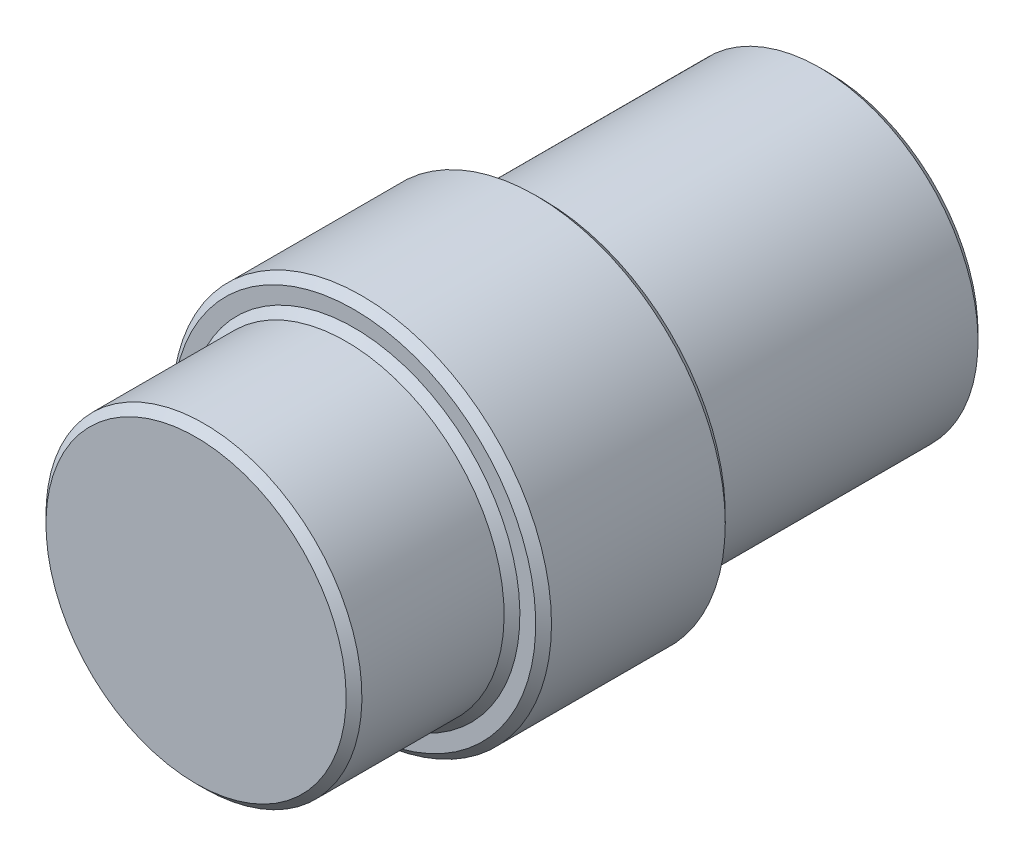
ISO-10303-21;
HEADER;
FILE_DESCRIPTION(('STEP AP214'),'2;1');
FILE_NAME('part.step','',(''),(''),'','','');
FILE_SCHEMA(('AUTOMOTIVE_DESIGN { 1 0 10303 214 1 1 1 1 }'));
ENDSEC;
DATA;
#1=APPLICATION_CONTEXT('core data for automotive mechanical design processes');
#2=APPLICATION_PROTOCOL_DEFINITION('international standard','automotive_design',2000,#1);
#3=PRODUCT_CONTEXT('',#1,'mechanical');
#4=PRODUCT('Part','Part','',(#3));
#5=PRODUCT_RELATED_PRODUCT_CATEGORY('part','',(#4));
#6=PRODUCT_DEFINITION_FORMATION('','',#4);
#7=PRODUCT_DEFINITION_CONTEXT('part definition',#1,'design');
#8=PRODUCT_DEFINITION('design','',#6,#7);
#9=PRODUCT_DEFINITION_SHAPE('','',#8);
#10=(LENGTH_UNIT() NAMED_UNIT(*) SI_UNIT(.MILLI.,.METRE.));
#11=(NAMED_UNIT(*) PLANE_ANGLE_UNIT() SI_UNIT($,.RADIAN.));
#12=(NAMED_UNIT(*) SI_UNIT($,.STERADIAN.) SOLID_ANGLE_UNIT());
#13=UNCERTAINTY_MEASURE_WITH_UNIT(LENGTH_MEASURE(1.E-05),#10,'distance_accuracy_value','');
#14=(GEOMETRIC_REPRESENTATION_CONTEXT(3) GLOBAL_UNCERTAINTY_ASSIGNED_CONTEXT((#13)) GLOBAL_UNIT_ASSIGNED_CONTEXT((#10,
#11,#12)) REPRESENTATION_CONTEXT('',''));
#15=CARTESIAN_POINT('',(0.,0.,0.));
#16=DIRECTION('',(0.,0.,1.));
#17=DIRECTION('',(1.,0.,0.));
#18=AXIS2_PLACEMENT_3D('',#15,#16,#17);
#19=CARTESIAN_POINT('',(0.,0.,0.));
#20=DIRECTION('',(0.,0.,1.));
#21=DIRECTION('',(0.,-1.,0.));
#22=AXIS2_PLACEMENT_3D('',#19,#20,#21);
#23=PLANE('',#22);
#24=CARTESIAN_POINT('',(0.,0.,0.));
#25=DIRECTION('',(0.,0.,1.));
#26=DIRECTION('',(0.,-1.,0.));
#27=AXIS2_PLACEMENT_3D('',#24,#25,#26);
#28=CIRCLE('',#27,9.49999999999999);
#29=CARTESIAN_POINT('',(0.,-9.49999999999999,0.));
#30=VERTEX_POINT('',#29);
#31=EDGE_CURVE('E10',#30,#30,#28,.T.);
#32=ORIENTED_EDGE('',*,*,#31,.T.);
#33=EDGE_LOOP('',(#32));
#34=FACE_BOUND('',#33,.T.);
#35=ADVANCED_FACE('F29',(#34),#23,.T.);
#36=CARTESIAN_POINT('',(0.,0.,-40.));
#37=DIRECTION('',(0.,0.,-1.));
#38=DIRECTION('',(0.,1.,0.));
#39=AXIS2_PLACEMENT_3D('',#36,#37,#38);
#40=CYLINDRICAL_SURFACE('',#39,10.);
#41=CARTESIAN_POINT('',(0.,0.,-9.50000000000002));
#42=DIRECTION('',(0.,0.,1.));
#43=DIRECTION('',(0.,-1.,0.));
#44=AXIS2_PLACEMENT_3D('',#41,#42,#43);
#45=CIRCLE('',#44,10.);
#46=CARTESIAN_POINT('',(0.,-10.,-9.50000000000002));
#47=VERTEX_POINT('',#46);
#48=EDGE_CURVE('E36',#47,#47,#45,.T.);
#49=ORIENTED_EDGE('',*,*,#48,.T.);
#50=EDGE_LOOP('',(#49));
#51=FACE_BOUND('',#50,.T.);
#52=CARTESIAN_POINT('',(0.,0.,-0.500000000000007));
#53=DIRECTION('',(0.,0.,1.));
#54=DIRECTION('',(0.,-1.,0.));
#55=AXIS2_PLACEMENT_3D('',#52,#53,#54);
#56=CIRCLE('',#55,10.);
#57=CARTESIAN_POINT('',(0.,-10.,-0.500000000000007));
#58=VERTEX_POINT('',#57);
#59=EDGE_CURVE('E40',#58,#58,#56,.F.);
#60=ORIENTED_EDGE('',*,*,#59,.T.);
#61=EDGE_LOOP('',(#60));
#62=FACE_BOUND('',#61,.T.);
#63=ADVANCED_FACE('F100',(#51,#62),#40,.T.);
#64=CARTESIAN_POINT('',(0.,10.,-10.));
#65=DIRECTION('',(0.,0.,1.));
#66=DIRECTION('',(0.,-1.,0.));
#67=AXIS2_PLACEMENT_3D('',#64,#65,#66);
#68=PLANE('',#67);
#69=CARTESIAN_POINT('',(0.,0.,-10.));
#70=DIRECTION('',(0.,0.,1.));
#71=DIRECTION('',(0.,-1.,0.));
#72=AXIS2_PLACEMENT_3D('',#69,#70,#71);
#73=CIRCLE('',#72,11.5);
#74=CARTESIAN_POINT('',(0.,-11.5,-10.));
#75=VERTEX_POINT('',#74);
#76=EDGE_CURVE('E55',#75,#75,#73,.T.);
#77=ORIENTED_EDGE('',*,*,#76,.T.);
#78=EDGE_LOOP('',(#77));
#79=FACE_BOUND('',#78,.T.);
#80=CARTESIAN_POINT('',(0.,0.,-10.));
#81=DIRECTION('',(0.,0.,1.));
#82=DIRECTION('',(0.,-1.,0.));
#83=AXIS2_PLACEMENT_3D('',#80,#81,#82);
#84=CIRCLE('',#83,10.5);
#85=CARTESIAN_POINT('',(0.,-10.5,-10.));
#86=VERTEX_POINT('',#85);
#87=EDGE_CURVE('E58',#86,#86,#84,.F.);
#88=ORIENTED_EDGE('',*,*,#87,.T.);
#89=EDGE_LOOP('',(#88));
#90=FACE_BOUND('',#89,.T.);
#91=ADVANCED_FACE('F105',(#79,#90),#68,.T.);
#92=CARTESIAN_POINT('',(0.,0.,-40.));
#93=DIRECTION('',(0.,0.,-1.));
#94=DIRECTION('',(0.,1.,0.));
#95=AXIS2_PLACEMENT_3D('',#92,#93,#94);
#96=CYLINDRICAL_SURFACE('',#95,12.);
#97=CARTESIAN_POINT('',(0.,0.,-21.5));
#98=DIRECTION('',(0.,0.,-1.));
#99=DIRECTION('',(0.,1.,0.));
#100=AXIS2_PLACEMENT_3D('',#97,#98,#99);
#101=CIRCLE('',#100,12.);
#102=CARTESIAN_POINT('',(0.,12.,-21.5));
#103=VERTEX_POINT('',#102);
#104=EDGE_CURVE('E61',#103,#103,#101,.F.);
#105=ORIENTED_EDGE('',*,*,#104,.T.);
#106=EDGE_LOOP('',(#105));
#107=FACE_BOUND('',#106,.T.);
#108=CARTESIAN_POINT('',(0.,0.,-10.5));
#109=DIRECTION('',(0.,0.,1.));
#110=DIRECTION('',(0.,-1.,0.));
#111=AXIS2_PLACEMENT_3D('',#108,#109,#110);
#112=CIRCLE('',#111,12.);
#113=CARTESIAN_POINT('',(0.,-12.,-10.5));
#114=VERTEX_POINT('',#113);
#115=EDGE_CURVE('E64',#114,#114,#112,.F.);
#116=ORIENTED_EDGE('',*,*,#115,.T.);
#117=EDGE_LOOP('',(#116));
#118=FACE_BOUND('',#117,.T.);
#119=ADVANCED_FACE('F96',(#107,#118),#96,.T.);
#120=CARTESIAN_POINT('',(0.,12.,-22.));
#121=DIRECTION('',(0.,0.,-1.));
#122=DIRECTION('',(0.,1.,0.));
#123=AXIS2_PLACEMENT_3D('',#120,#121,#122);
#124=PLANE('',#123);
#125=CARTESIAN_POINT('',(0.,0.,-22.));
#126=DIRECTION('',(0.,0.,-1.));
#127=DIRECTION('',(0.,1.,0.));
#128=AXIS2_PLACEMENT_3D('',#125,#126,#127);
#129=CIRCLE('',#128,11.5);
#130=CARTESIAN_POINT('',(0.,11.5,-22.));
#131=VERTEX_POINT('',#130);
#132=EDGE_CURVE('E67',#131,#131,#129,.T.);
#133=ORIENTED_EDGE('',*,*,#132,.T.);
#134=EDGE_LOOP('',(#133));
#135=FACE_BOUND('',#134,.T.);
#136=CARTESIAN_POINT('',(0.,0.,-22.));
#137=DIRECTION('',(0.,0.,-1.));
#138=DIRECTION('',(0.,1.,0.));
#139=AXIS2_PLACEMENT_3D('',#136,#137,#138);
#140=CIRCLE('',#139,10.5);
#141=CARTESIAN_POINT('',(0.,10.5,-22.));
#142=VERTEX_POINT('',#141);
#143=EDGE_CURVE('E70',#142,#142,#140,.F.);
#144=ORIENTED_EDGE('',*,*,#143,.T.);
#145=EDGE_LOOP('',(#144));
#146=FACE_BOUND('',#145,.T.);
#147=ADVANCED_FACE('F74',(#135,#146),#124,.T.);
#148=CARTESIAN_POINT('',(0.,0.,-40.));
#149=DIRECTION('',(0.,0.,-1.));
#150=DIRECTION('',(0.,1.,0.));
#151=AXIS2_PLACEMENT_3D('',#148,#149,#150);
#152=CYLINDRICAL_SURFACE('',#151,10.);
#153=CARTESIAN_POINT('',(0.,0.,-39.5));
#154=DIRECTION('',(0.,0.,-1.));
#155=DIRECTION('',(0.,1.,0.));
#156=AXIS2_PLACEMENT_3D('',#153,#154,#155);
#157=CIRCLE('',#156,10.);
#158=CARTESIAN_POINT('',(0.,9.99999999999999,-39.5));
#159=VERTEX_POINT('',#158);
#160=EDGE_CURVE('E44',#159,#159,#157,.F.);
#161=ORIENTED_EDGE('',*,*,#160,.T.);
#162=EDGE_LOOP('',(#161));
#163=FACE_BOUND('',#162,.T.);
#164=CARTESIAN_POINT('',(0.,0.,-22.5));
#165=DIRECTION('',(0.,0.,-1.));
#166=DIRECTION('',(0.,1.,0.));
#167=AXIS2_PLACEMENT_3D('',#164,#165,#166);
#168=CIRCLE('',#167,10.);
#169=CARTESIAN_POINT('',(0.,10.,-22.5));
#170=VERTEX_POINT('',#169);
#171=EDGE_CURVE('E49',#170,#170,#168,.T.);
#172=ORIENTED_EDGE('',*,*,#171,.T.);
#173=EDGE_LOOP('',(#172));
#174=FACE_BOUND('',#173,.T.);
#175=ADVANCED_FACE('F84',(#163,#174),#152,.T.);
#176=CARTESIAN_POINT('',(0.,9.99999999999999,-40.));
#177=DIRECTION('',(0.,0.,-1.));
#178=DIRECTION('',(0.,1.,0.));
#179=AXIS2_PLACEMENT_3D('',#176,#177,#178);
#180=PLANE('',#179);
#181=CARTESIAN_POINT('',(0.,0.,-40.));
#182=DIRECTION('',(0.,0.,-1.));
#183=DIRECTION('',(0.,1.,0.));
#184=AXIS2_PLACEMENT_3D('',#181,#182,#183);
#185=CIRCLE('',#184,9.5);
#186=CARTESIAN_POINT('',(0.,9.49999999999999,-40.));
#187=VERTEX_POINT('',#186);
#188=EDGE_CURVE('E52',#187,#187,#185,.T.);
#189=ORIENTED_EDGE('',*,*,#188,.T.);
#190=EDGE_LOOP('',(#189));
#191=FACE_BOUND('',#190,.T.);
#192=ADVANCED_FACE('F86',(#191),#180,.T.);
#193=CARTESIAN_POINT('',(0.,0.,-22.));
#194=DIRECTION('',(0.,0.,1.));
#195=DIRECTION('',(0.,-1.,0.));
#196=AXIS2_PLACEMENT_3D('',#193,#194,#195);
#197=CONICAL_SURFACE('',#196,11.5,0.785398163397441);
#198=ORIENTED_EDGE('',*,*,#104,.F.);
#199=EDGE_LOOP('',(#198));
#200=FACE_BOUND('',#199,.T.);
#201=ORIENTED_EDGE('',*,*,#132,.F.);
#202=EDGE_LOOP('',(#201));
#203=FACE_BOUND('',#202,.T.);
#204=ADVANCED_FACE('F93',(#200,#203),#197,.T.);
#205=CARTESIAN_POINT('',(0.,0.,-10.5));
#206=DIRECTION('',(0.,0.,-1.));
#207=DIRECTION('',(0.,1.,0.));
#208=AXIS2_PLACEMENT_3D('',#205,#206,#207);
#209=CONICAL_SURFACE('',#208,12.,0.785398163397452);
#210=ORIENTED_EDGE('',*,*,#76,.F.);
#211=EDGE_LOOP('',(#210));
#212=FACE_BOUND('',#211,.T.);
#213=ORIENTED_EDGE('',*,*,#115,.F.);
#214=EDGE_LOOP('',(#213));
#215=FACE_BOUND('',#214,.T.);
#216=ADVANCED_FACE('F111',(#212,#215),#209,.T.);
#217=CARTESIAN_POINT('',(0.,0.,-40.));
#218=DIRECTION('',(0.,0.,1.));
#219=DIRECTION('',(0.,-1.,0.));
#220=AXIS2_PLACEMENT_3D('',#217,#218,#219);
#221=CONICAL_SURFACE('',#220,9.5,0.785398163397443);
#222=ORIENTED_EDGE('',*,*,#160,.F.);
#223=EDGE_LOOP('',(#222));
#224=FACE_BOUND('',#223,.T.);
#225=ORIENTED_EDGE('',*,*,#188,.F.);
#226=EDGE_LOOP('',(#225));
#227=FACE_BOUND('',#226,.T.);
#228=ADVANCED_FACE('F80',(#224,#227),#221,.T.);
#229=CARTESIAN_POINT('',(0.,0.,-22.5));
#230=DIRECTION('',(0.,0.,1.));
#231=DIRECTION('',(0.,-1.,0.));
#232=AXIS2_PLACEMENT_3D('',#229,#230,#231);
#233=CONICAL_SURFACE('',#232,10.,0.785398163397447);
#234=ORIENTED_EDGE('',*,*,#143,.F.);
#235=EDGE_LOOP('',(#234));
#236=FACE_BOUND('',#235,.T.);
#237=ORIENTED_EDGE('',*,*,#171,.F.);
#238=EDGE_LOOP('',(#237));
#239=FACE_BOUND('',#238,.T.);
#240=ADVANCED_FACE('F76',(#236,#239),#233,.T.);
#241=CARTESIAN_POINT('',(0.,0.,-10.));
#242=DIRECTION('',(0.,0.,-1.));
#243=DIRECTION('',(0.,1.,0.));
#244=AXIS2_PLACEMENT_3D('',#241,#242,#243);
#245=CONICAL_SURFACE('',#244,10.5,0.785398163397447);
#246=ORIENTED_EDGE('',*,*,#48,.F.);
#247=EDGE_LOOP('',(#246));
#248=FACE_BOUND('',#247,.T.);
#249=ORIENTED_EDGE('',*,*,#87,.F.);
#250=EDGE_LOOP('',(#249));
#251=FACE_BOUND('',#250,.T.);
#252=ADVANCED_FACE('F79',(#248,#251),#245,.T.);
#253=CARTESIAN_POINT('',(0.,0.,-0.500000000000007));
#254=DIRECTION('',(0.,0.,-1.));
#255=DIRECTION('',(0.,1.,0.));
#256=AXIS2_PLACEMENT_3D('',#253,#254,#255);
#257=CONICAL_SURFACE('',#256,10.,0.785398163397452);
#258=ORIENTED_EDGE('',*,*,#31,.F.);
#259=EDGE_LOOP('',(#258));
#260=FACE_BOUND('',#259,.T.);
#261=ORIENTED_EDGE('',*,*,#59,.F.);
#262=EDGE_LOOP('',(#261));
#263=FACE_BOUND('',#262,.T.);
#264=ADVANCED_FACE('F31',(#260,#263),#257,.T.);
#265=CLOSED_SHELL('',(#35,#63,#91,#119,#147,#175,#192,#204,#216,#228,#240,#252,#264));
#266=MANIFOLD_SOLID_BREP('B2',#265);
#267=ADVANCED_BREP_SHAPE_REPRESENTATION('',(#18,#266),#14);
#268=SHAPE_DEFINITION_REPRESENTATION(#9,#267);
ENDSEC;
END-ISO-10303-21;
